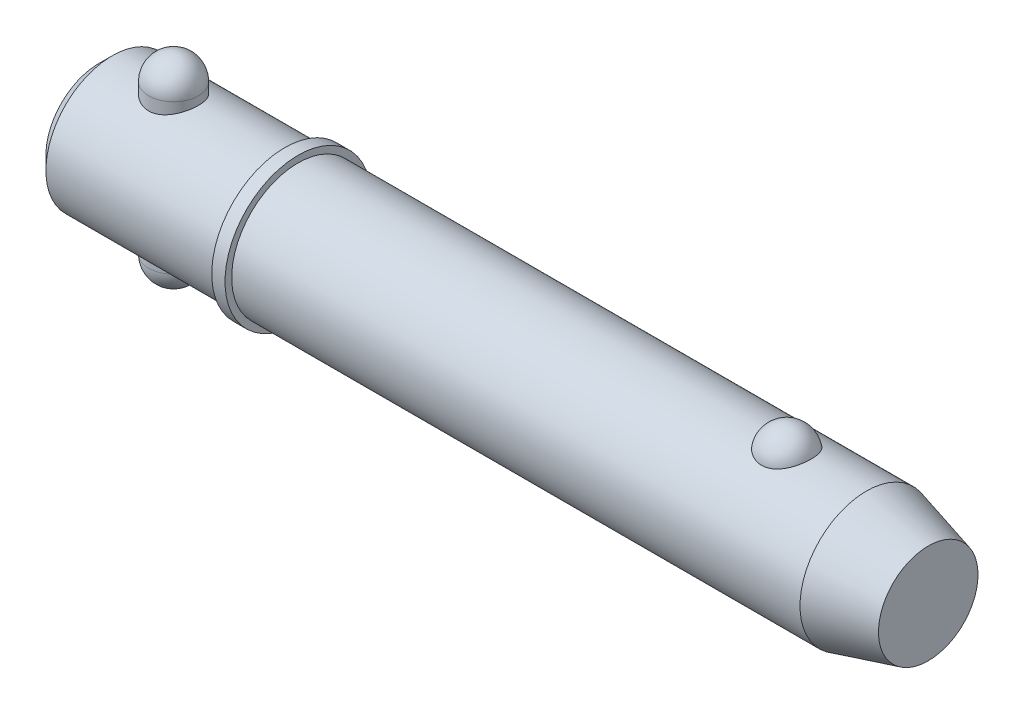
ISO-10303-21;
HEADER;
FILE_DESCRIPTION(('STEP AP214'),'2;1');
FILE_NAME('part.step','',(''),(''),'','','');
FILE_SCHEMA(('AUTOMOTIVE_DESIGN { 1 0 10303 214 1 1 1 1 }'));
ENDSEC;
DATA;
#1=APPLICATION_CONTEXT('core data for automotive mechanical design processes');
#2=APPLICATION_PROTOCOL_DEFINITION('international standard','automotive_design',2000,#1);
#3=PRODUCT_CONTEXT('',#1,'mechanical');
#4=PRODUCT('Part','Part','',(#3));
#5=PRODUCT_RELATED_PRODUCT_CATEGORY('part','',(#4));
#6=PRODUCT_DEFINITION_FORMATION('','',#4);
#7=PRODUCT_DEFINITION_CONTEXT('part definition',#1,'design');
#8=PRODUCT_DEFINITION('design','',#6,#7);
#9=PRODUCT_DEFINITION_SHAPE('','',#8);
#10=(LENGTH_UNIT() NAMED_UNIT(*) SI_UNIT(.MILLI.,.METRE.));
#11=(NAMED_UNIT(*) PLANE_ANGLE_UNIT() SI_UNIT($,.RADIAN.));
#12=(NAMED_UNIT(*) SI_UNIT($,.STERADIAN.) SOLID_ANGLE_UNIT());
#13=UNCERTAINTY_MEASURE_WITH_UNIT(LENGTH_MEASURE(1.E-05),#10,'distance_accuracy_value','');
#14=(GEOMETRIC_REPRESENTATION_CONTEXT(3) GLOBAL_UNCERTAINTY_ASSIGNED_CONTEXT((#13)) GLOBAL_UNIT_ASSIGNED_CONTEXT((#10,
#11,#12)) REPRESENTATION_CONTEXT('',''));
#15=CARTESIAN_POINT('',(0.,0.,0.));
#16=DIRECTION('',(0.,0.,1.));
#17=DIRECTION('',(1.,0.,0.));
#18=AXIS2_PLACEMENT_3D('',#15,#16,#17);
#19=CARTESIAN_POINT('',(14.28,19.05,0.));
#20=DIRECTION('',(0.,-1.,0.));
#21=DIRECTION('',(0.,0.,-1.));
#22=AXIS2_PLACEMENT_3D('',#19,#20,#21);
#23=CYLINDRICAL_SURFACE('',#22,4.76);
#24=CARTESIAN_POINT('',(14.28,-14.29,0.));
#25=DIRECTION('',(0.,-1.,0.));
#26=DIRECTION('',(0.,0.,-1.));
#27=AXIS2_PLACEMENT_3D('',#24,#25,#26);
#28=CIRCLE('',#27,4.76);
#29=CARTESIAN_POINT('',(14.28,-14.29,-4.76));
#30=VERTEX_POINT('',#29);
#31=EDGE_CURVE('P0_E10',#30,#30,#28,.F.);
#32=CARTESIAN_POINT('',(14.28,14.29,0.));
#33=DIRECTION('',(0.,-1.,0.));
#34=DIRECTION('',(0.,0.,-1.));
#35=AXIS2_PLACEMENT_3D('',#32,#33,#34);
#36=CIRCLE('',#35,4.76);
#37=CARTESIAN_POINT('',(14.28,14.29,-4.76));
#38=VERTEX_POINT('',#37);
#39=EDGE_CURVE('P0_E21',#38,#38,#36,.T.);
#40=CARTESIAN_POINT('',(14.28,-14.29,-4.76));
#41=CARTESIAN_POINT('',(14.28,-13.9922916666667,-4.76));
#42=CARTESIAN_POINT('',(14.28,-13.6945833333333,-4.76));
#43=CARTESIAN_POINT('',(14.28,-13.0991666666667,-4.76));
#44=CARTESIAN_POINT('',(14.28,-12.8014583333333,-4.76));
#45=CARTESIAN_POINT('',(14.28,-12.2060416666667,-4.76));
#46=CARTESIAN_POINT('',(14.28,-11.9083333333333,-4.76));
#47=CARTESIAN_POINT('',(14.28,-11.3129166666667,-4.76));
#48=CARTESIAN_POINT('',(14.28,-11.0152083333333,-4.76));
#49=CARTESIAN_POINT('',(14.28,-10.4197916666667,-4.76));
#50=CARTESIAN_POINT('',(14.28,-10.1220833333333,-4.76));
#51=CARTESIAN_POINT('',(14.28,-9.52666666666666,-4.76));
#52=CARTESIAN_POINT('',(14.28,-9.22895833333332,-4.76));
#53=CARTESIAN_POINT('',(14.28,-8.63354166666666,-4.76));
#54=CARTESIAN_POINT('',(14.28,-8.33583333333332,-4.76));
#55=CARTESIAN_POINT('',(14.28,-7.74041666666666,-4.76));
#56=CARTESIAN_POINT('',(14.28,-7.44270833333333,-4.76));
#57=CARTESIAN_POINT('',(14.28,-6.84729166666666,-4.76));
#58=CARTESIAN_POINT('',(14.28,-6.54958333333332,-4.76));
#59=CARTESIAN_POINT('',(14.28,-5.95416666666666,-4.76));
#60=CARTESIAN_POINT('',(14.28,-5.65645833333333,-4.76));
#61=CARTESIAN_POINT('',(14.28,-5.06104166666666,-4.76));
#62=CARTESIAN_POINT('',(14.28,-4.76333333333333,-4.76));
#63=CARTESIAN_POINT('',(14.28,-4.16791666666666,-4.76));
#64=CARTESIAN_POINT('',(14.28,-3.87020833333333,-4.76));
#65=CARTESIAN_POINT('',(14.28,-3.27479166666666,-4.76));
#66=CARTESIAN_POINT('',(14.28,-2.97708333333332,-4.76));
#67=CARTESIAN_POINT('',(14.28,-2.38166666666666,-4.76));
#68=CARTESIAN_POINT('',(14.28,-2.08395833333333,-4.76));
#69=CARTESIAN_POINT('',(14.28,-1.48854166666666,-4.76));
#70=CARTESIAN_POINT('',(14.28,-1.19083333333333,-4.76));
#71=CARTESIAN_POINT('',(14.28,-0.595416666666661,-4.76));
#72=CARTESIAN_POINT('',(14.28,-0.297708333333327,-4.76));
#73=CARTESIAN_POINT('',(14.28,0.297708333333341,-4.76));
#74=CARTESIAN_POINT('',(14.28,0.595416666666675,-4.76));
#75=CARTESIAN_POINT('',(14.28,1.19083333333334,-4.76));
#76=CARTESIAN_POINT('',(14.28,1.48854166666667,-4.76));
#77=CARTESIAN_POINT('',(14.28,2.08395833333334,-4.76));
#78=CARTESIAN_POINT('',(14.28,2.38166666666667,-4.76));
#79=CARTESIAN_POINT('',(14.28,2.97708333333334,-4.76));
#80=CARTESIAN_POINT('',(14.28,3.27479166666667,-4.76));
#81=CARTESIAN_POINT('',(14.28,3.87020833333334,-4.76));
#82=CARTESIAN_POINT('',(14.28,4.16791666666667,-4.76));
#83=CARTESIAN_POINT('',(14.28,4.76333333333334,-4.76));
#84=CARTESIAN_POINT('',(14.28,5.06104166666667,-4.76));
#85=CARTESIAN_POINT('',(14.28,5.65645833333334,-4.76));
#86=CARTESIAN_POINT('',(14.28,5.95416666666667,-4.76));
#87=CARTESIAN_POINT('',(14.28,6.54958333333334,-4.76));
#88=CARTESIAN_POINT('',(14.28,6.84729166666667,-4.76));
#89=CARTESIAN_POINT('',(14.28,7.44270833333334,-4.76));
#90=CARTESIAN_POINT('',(14.28,7.74041666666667,-4.76));
#91=CARTESIAN_POINT('',(14.28,8.33583333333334,-4.76));
#92=CARTESIAN_POINT('',(14.28,8.63354166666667,-4.76));
#93=CARTESIAN_POINT('',(14.28,9.22895833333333,-4.76));
#94=CARTESIAN_POINT('',(14.28,9.52666666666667,-4.76));
#95=CARTESIAN_POINT('',(14.28,10.1220833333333,-4.76));
#96=CARTESIAN_POINT('',(14.28,10.4197916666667,-4.76));
#97=CARTESIAN_POINT('',(14.28,11.0152083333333,-4.76));
#98=CARTESIAN_POINT('',(14.28,11.3129166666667,-4.76));
#99=CARTESIAN_POINT('',(14.28,11.9083333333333,-4.76));
#100=CARTESIAN_POINT('',(14.28,12.2060416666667,-4.76));
#101=CARTESIAN_POINT('',(14.28,12.8014583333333,-4.76));
#102=CARTESIAN_POINT('',(14.28,13.0991666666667,-4.76));
#103=CARTESIAN_POINT('',(14.28,13.6945833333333,-4.76));
#104=CARTESIAN_POINT('',(14.28,13.9922916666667,-4.76));
#105=CARTESIAN_POINT('',(14.28,14.29,-4.76));
#106=B_SPLINE_CURVE_WITH_KNOTS('',3,(#40,#41,#42,#43,#44,#45,#46,#47,#48,#49,#50,#51,#52,#53,
#54,#55,#56,#57,#58,#59,#60,#61,#62,#63,#64,#65,#66,#67,#68,#69,#70,#71,#72,#73,#74,#75,#76,#77,
#78,#79,#80,#81,#82,#83,#84,#85,#86,#87,#88,#89,#90,#91,#92,#93,#94,#95,#96,#97,#98,#99,#100,
#101,#102,#103,#104,#105),.UNSPECIFIED.,.F.,.F.,(4,2,2,2,2,2,2,2,2,2,2,2,2,2,2,2,2,2,2,2,2,2,2,
2,2,2,2,2,2,2,2,2,4),(0.,0.893125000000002,1.78625,2.67937499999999,3.5725,4.465625,5.35875,
6.25187499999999,7.145,8.038125,8.93125,9.82437499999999,10.7175,11.610625,12.50375,13.396875,
14.29,15.183125,16.07625,16.969375,17.8625,18.755625,19.64875,20.541875,21.435,22.328125,
23.22125,24.114375,25.0075,25.900625,26.79375,27.686875,28.58),.UNSPECIFIED.);
#107=EDGE_CURVE('P0_BSEAM14',#30,#38,#106,.T.);
#108=ORIENTED_EDGE('',*,*,#31,.T.);
#109=ORIENTED_EDGE('',*,*,#39,.T.);
#110=ORIENTED_EDGE('',*,*,#107,.T.);
#111=ORIENTED_EDGE('',*,*,#107,.F.);
#112=EDGE_LOOP('',(#108,#110,#109,#111));
#113=FACE_BOUND('',#112,.T.);
#114=ADVANCED_FACE('P0_F14',(#113),#23,.T.);
#115=CARTESIAN_POINT('',(14.28,-14.29,0.));
#116=DIRECTION('',(0.,0.,1.));
#117=DIRECTION('',(1.,0.,0.));
#118=AXIS2_PLACEMENT_3D('',#115,#116,#117);
#119=SPHERICAL_SURFACE('',#118,4.76);
#120=CARTESIAN_POINT('',(14.28,-14.29,0.));
#121=DIRECTION('',(0.,-1.,0.));
#122=DIRECTION('',(0.,0.,-1.));
#123=AXIS2_PLACEMENT_3D('',#120,#121,#122);
#124=SPHERICAL_SURFACE('',#123,4.76);
#125=ORIENTED_EDGE('',*,*,#31,.F.);
#126=EDGE_LOOP('',(#125));
#127=FACE_BOUND('',#126,.T.);
#128=ADVANCED_FACE('P0_F29',(#127),#124,.T.);
#129=CARTESIAN_POINT('',(14.28,14.29,0.));
#130=DIRECTION('',(0.,0.,1.));
#131=DIRECTION('',(1.,0.,0.));
#132=AXIS2_PLACEMENT_3D('',#129,#130,#131);
#133=SPHERICAL_SURFACE('',#132,4.76);
#134=CARTESIAN_POINT('',(14.28,14.29,0.));
#135=DIRECTION('',(0.,-1.,0.));
#136=DIRECTION('',(0.,0.,-1.));
#137=AXIS2_PLACEMENT_3D('',#134,#135,#136);
#138=SPHERICAL_SURFACE('',#137,4.76);
#139=ORIENTED_EDGE('',*,*,#39,.F.);
#140=EDGE_LOOP('',(#139));
#141=FACE_BOUND('',#140,.T.);
#142=ADVANCED_FACE('P0_F16',(#141),#138,.T.);
#143=CLOSED_SHELL('',(#114,#128,#142));
#144=MANIFOLD_SOLID_BREP('P0_B1',#143);
#145=CARTESIAN_POINT('',(0.,0.,0.));
#146=DIRECTION('',(1.,0.,0.));
#147=DIRECTION('',(0.,0.,-1.));
#148=AXIS2_PLACEMENT_3D('',#145,#146,#147);
#149=CYLINDRICAL_SURFACE('',#148,12.7);
#150=CARTESIAN_POINT('',(146.900738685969,0.,0.));
#151=DIRECTION('',(1.,0.,0.));
#152=DIRECTION('',(0.,0.,-1.));
#153=AXIS2_PLACEMENT_3D('',#150,#151,#152);
#154=CIRCLE('',#153,12.7);
#155=CARTESIAN_POINT('',(146.900738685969,0.,-12.7));
#156=VERTEX_POINT('',#155);
#157=EDGE_CURVE('P1_E81',#156,#156,#154,.T.);
#158=ORIENTED_EDGE('',*,*,#157,.F.);
#159=EDGE_LOOP('',(#158));
#160=FACE_BOUND('',#159,.T.);
#161=CARTESIAN_POINT('',(38.1,0.,0.));
#162=DIRECTION('',(1.,0.,0.));
#163=DIRECTION('',(0.,0.,-1.));
#164=AXIS2_PLACEMENT_3D('',#161,#162,#163);
#165=CIRCLE('',#164,12.7);
#166=CARTESIAN_POINT('',(38.1,0.,-12.7));
#167=VERTEX_POINT('',#166);
#168=EDGE_CURVE('P1_E85',#167,#167,#165,.T.);
#169=ORIENTED_EDGE('',*,*,#168,.T.);
#170=EDGE_LOOP('',(#169));
#171=FACE_BOUND('',#170,.T.);
#172=CARTESIAN_POINT('',(131.660042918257,11.7500437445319,4.81938502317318));
#173=CARTESIAN_POINT('',(131.535088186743,11.7500430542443,4.81938571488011));
#174=CARTESIAN_POINT('',(131.410144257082,11.7520975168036,4.81438658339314));
#175=CARTESIAN_POINT('',(131.161142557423,11.760253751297,4.79442904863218));
#176=CARTESIAN_POINT('',(131.037085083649,11.7663568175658,4.77946746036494));
#177=CARTESIAN_POINT('',(130.790901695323,11.7824262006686,4.7397141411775));
#178=CARTESIAN_POINT('',(130.668774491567,11.7923898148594,4.71492928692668));
#179=CARTESIAN_POINT('',(130.427187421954,11.8158938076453,4.65571340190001));
#180=CARTESIAN_POINT('',(130.30772859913,11.8294355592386,4.6212786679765));
#181=CARTESIAN_POINT('',(130.072557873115,11.8596812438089,4.54309502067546));
#182=CARTESIAN_POINT('',(129.956839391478,11.8763792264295,4.49936361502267));
#183=CARTESIAN_POINT('',(129.729653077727,11.9124878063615,4.40287235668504));
#184=CARTESIAN_POINT('',(129.618186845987,11.9318994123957,4.35010914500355));
#185=CARTESIAN_POINT('',(129.291278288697,11.9934256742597,4.17881316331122));
#186=CARTESIAN_POINT('',(129.083127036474,12.038858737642,4.04720756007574));
#187=CARTESIAN_POINT('',(128.685850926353,12.1352173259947,3.748564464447));
#188=CARTESIAN_POINT('',(128.497443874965,12.1862630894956,3.58061821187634));
#189=CARTESIAN_POINT('',(128.150521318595,12.2875163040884,3.21600758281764));
#190=CARTESIAN_POINT('',(127.992011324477,12.3377235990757,3.0193379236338));
#191=CARTESIAN_POINT('',(127.70168878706,12.4344923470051,2.592916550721));
#192=CARTESIAN_POINT('',(127.571376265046,12.4807925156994,2.36208286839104));
#193=CARTESIAN_POINT('',(127.349407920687,12.5623454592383,1.88070399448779));
#194=CARTESIAN_POINT('',(127.257755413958,12.5975972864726,1.63015711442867));
#195=CARTESIAN_POINT('',(127.114046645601,12.6538414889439,1.1129886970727));
#196=CARTESIAN_POINT('',(127.062499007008,12.6746503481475,0.846205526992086));
#197=CARTESIAN_POINT('',(127.001977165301,12.699153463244,0.307085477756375));
#198=CARTESIAN_POINT('',(126.993001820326,12.7028481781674,0.034748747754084));
#199=CARTESIAN_POINT('',(127.017731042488,12.6927785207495,-0.506073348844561));
#200=CARTESIAN_POINT('',(127.051189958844,12.6791146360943,-0.774571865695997));
#201=CARTESIAN_POINT('',(127.159687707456,12.635882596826,-1.30170246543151));
#202=CARTESIAN_POINT('',(127.23472729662,12.606314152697,-1.56033436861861));
#203=CARTESIAN_POINT('',(127.42500006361,12.5342328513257,-2.0608389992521));
#204=CARTESIAN_POINT('',(127.540287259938,12.4917026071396,-2.30268867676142));
#205=CARTESIAN_POINT('',(127.808704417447,12.3981123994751,-2.76259600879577));
#206=CARTESIAN_POINT('',(127.961837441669,12.3470517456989,-2.98065173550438));
#207=CARTESIAN_POINT('',(128.303507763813,12.2416045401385,-3.38786328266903));
#208=CARTESIAN_POINT('',(128.492201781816,12.1872040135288,-3.57688418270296));
#209=CARTESIAN_POINT('',(128.900239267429,12.0814086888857,-3.91941073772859));
#210=CARTESIAN_POINT('',(129.119580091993,12.0300136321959,-4.07291945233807));
#211=CARTESIAN_POINT('',(129.578375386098,11.9373542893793,-4.33691289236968));
#212=CARTESIAN_POINT('',(129.817304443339,11.8958982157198,-4.44824125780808));
#213=CARTESIAN_POINT('',(130.31243761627,11.8268116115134,-4.62881985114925));
#214=CARTESIAN_POINT('',(130.568635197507,11.7991758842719,-4.69808589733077));
#215=CARTESIAN_POINT('',(131.077164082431,11.7622209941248,-4.78983181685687));
#216=CARTESIAN_POINT('',(131.329041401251,11.7520502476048,-4.81449025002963));
#217=CARTESIAN_POINT('',(131.833573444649,11.7485796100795,-4.82295735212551));
#218=CARTESIAN_POINT('',(132.086228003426,11.7552763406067,-4.80677420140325));
#219=CARTESIAN_POINT('',(132.576834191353,11.7842584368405,-4.73525430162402));
#220=CARTESIAN_POINT('',(132.814998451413,11.8060486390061,-4.68116061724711));
#221=CARTESIAN_POINT('',(133.278489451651,11.8622750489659,-4.53678133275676));
#222=CARTESIAN_POINT('',(133.503815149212,11.8967122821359,-4.44649279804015));
#223=CARTESIAN_POINT('',(133.940801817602,11.9754603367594,-4.2298761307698));
#224=CARTESIAN_POINT('',(134.152057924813,12.0199699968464,-4.10280539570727));
#225=CARTESIAN_POINT('',(134.550601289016,12.1138028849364,-3.81685409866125));
#226=CARTESIAN_POINT('',(134.737883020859,12.163127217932,-3.65796622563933));
#227=CARTESIAN_POINT('',(135.093350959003,12.2642343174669,-3.30364864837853));
#228=CARTESIAN_POINT('',(135.260111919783,12.3160165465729,-3.10678783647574));
#229=CARTESIAN_POINT('',(135.559579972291,12.4142566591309,-2.68748409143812));
#230=CARTESIAN_POINT('',(135.692280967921,12.4607135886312,-2.4650365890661));
#231=CARTESIAN_POINT('',(135.924691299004,12.5450236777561,-1.9928951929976));
#232=CARTESIAN_POINT('',(136.023215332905,12.5825557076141,-1.74255918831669));
#233=CARTESIAN_POINT('',(136.179227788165,12.6431720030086,-1.22773734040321));
#234=CARTESIAN_POINT('',(136.236715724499,12.6662560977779,-0.963251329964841));
#235=CARTESIAN_POINT('',(136.309544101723,12.6956486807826,-0.4273550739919));
#236=CARTESIAN_POINT('',(136.324837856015,12.7019385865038,-0.155937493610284));
#237=CARTESIAN_POINT('',(136.312779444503,12.6970201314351,0.38592890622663));
#238=CARTESIAN_POINT('',(136.28542805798,12.6858120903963,0.656377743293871));
#239=CARTESIAN_POINT('',(136.213060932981,12.6568455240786,1.05454017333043));
#240=CARTESIAN_POINT('',(136.183796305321,12.6451962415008,1.185778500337));
#241=CARTESIAN_POINT('',(136.115022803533,12.6181819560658,1.44513808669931));
#242=CARTESIAN_POINT('',(136.075517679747,12.6028183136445,1.57326046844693));
#243=CARTESIAN_POINT('',(135.986439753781,12.5687547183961,1.82554978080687));
#244=CARTESIAN_POINT('',(135.936862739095,12.5500533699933,1.94971503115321));
#245=CARTESIAN_POINT('',(135.82792115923,12.5098093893,2.19314370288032));
#246=CARTESIAN_POINT('',(135.768560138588,12.4882677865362,2.31240887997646));
#247=CARTESIAN_POINT('',(135.63997128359,12.4427679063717,2.5459303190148));
#248=CARTESIAN_POINT('',(135.570688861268,12.4187964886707,2.66015396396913));
#249=CARTESIAN_POINT('',(135.422903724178,12.3691892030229,2.88202659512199));
#250=CARTESIAN_POINT('',(135.344404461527,12.3435539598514,2.98967802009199));
#251=CARTESIAN_POINT('',(135.178550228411,12.2912955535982,3.1977438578));
#252=CARTESIAN_POINT('',(135.091191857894,12.2646720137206,3.29815546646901));
#253=CARTESIAN_POINT('',(134.908161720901,12.2111945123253,3.49095035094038));
#254=CARTESIAN_POINT('',(134.812493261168,12.1843406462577,3.58333679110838));
#255=CARTESIAN_POINT('',(134.613627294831,12.1312249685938,3.75922876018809));
#256=CARTESIAN_POINT('',(134.510450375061,12.104961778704,3.84275713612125));
#257=CARTESIAN_POINT('',(134.29701336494,12.0537284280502,4.00056406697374));
#258=CARTESIAN_POINT('',(134.186756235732,12.028757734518,4.07484645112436));
#259=CARTESIAN_POINT('',(133.959755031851,11.9808306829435,4.21367959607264));
#260=CARTESIAN_POINT('',(133.843006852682,11.9578756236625,4.27822410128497));
#261=CARTESIAN_POINT('',(133.60394258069,11.9147184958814,4.39698483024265));
#262=CARTESIAN_POINT('',(133.481628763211,11.894515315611,4.45120522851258));
#263=CARTESIAN_POINT('',(133.222952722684,11.8561129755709,4.55255353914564));
#264=CARTESIAN_POINT('',(133.086223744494,11.8381764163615,4.59884858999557));
#265=CARTESIAN_POINT('',(132.808608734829,11.8069093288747,4.67853897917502));
#266=CARTESIAN_POINT('',(132.667724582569,11.7935767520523,4.71194005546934));
#267=CARTESIAN_POINT('',(132.38309446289,11.7720277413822,4.76552188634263));
#268=CARTESIAN_POINT('',(132.239348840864,11.7638106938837,4.78570422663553));
#269=CARTESIAN_POINT('',(131.950411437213,11.7528195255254,4.81263433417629));
#270=CARTESIAN_POINT('',(131.805219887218,11.7500445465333,4.81938421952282));
#271=CARTESIAN_POINT('',(131.660042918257,11.7500437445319,4.81938502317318));
#272=B_SPLINE_CURVE_WITH_KNOTS('',3,(#172,#173,#174,#175,#176,#177,#178,#179,#180,#181,#182,
#183,#184,#185,#186,#187,#188,#189,#190,#191,#192,#193,#194,#195,#196,#197,#198,#199,#200,#201,
#202,#203,#204,#205,#206,#207,#208,#209,#210,#211,#212,#213,#214,#215,#216,#217,#218,#219,#220,
#221,#222,#223,#224,#225,#226,#227,#228,#229,#230,#231,#232,#233,#234,#235,#236,#237,#238,#239,
#240,#241,#242,#243,#244,#245,#246,#247,#248,#249,#250,#251,#252,#253,#254,#255,#256,#257,#258,
#259,#260,#261,#262,#263,#264,#265,#266,#267,#268,#269,#270,#271),.UNSPECIFIED.,.T.,.F.,(4,2,2,
2,2,2,2,2,2,2,2,2,2,2,2,2,2,2,2,2,2,2,2,2,2,2,2,2,2,2,2,2,2,2,2,2,2,2,2,2,2,2,2,2,2,2,2,2,2,4),
(0.,0.374729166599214,0.749578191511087,1.12416526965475,1.49889629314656,1.87292776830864,
2.24709865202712,2.99481328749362,3.76399449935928,4.53331735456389,5.3368391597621,
6.14042986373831,6.95405296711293,7.76765424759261,8.57656703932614,9.38549455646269,
10.1955119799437,11.0055949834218,11.8193353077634,12.6330054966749,13.4294141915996,
14.2255231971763,14.9815786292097,15.7374826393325,16.4696948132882,17.2019663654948,
17.9501979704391,18.6986017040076,19.4844704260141,20.2704797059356,21.0815215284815,
21.8925729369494,22.7045213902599,23.5164550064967,23.9209608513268,24.3253187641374,
24.7298461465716,25.1342272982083,25.54092555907,25.9474719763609,26.3541750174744,
26.7607169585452,27.1661834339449,27.5714814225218,27.9770386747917,28.3824315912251,
28.818120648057,29.2536155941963,29.6890582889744,30.1244323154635),.UNSPECIFIED.);
#273=CARTESIAN_POINT('',(131.660042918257,11.7500437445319,4.81938502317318));
#274=VERTEX_POINT('',#273);
#275=EDGE_CURVE('P1_E35',#274,#274,#272,.T.);
#276=ORIENTED_EDGE('',*,*,#275,.T.);
#277=EDGE_LOOP('',(#276));
#278=FACE_BOUND('',#277,.T.);
#279=ADVANCED_FACE('P1_F13',(#160,#171,#278),#149,.T.);
#280=CARTESIAN_POINT('',(0.,0.,0.));
#281=DIRECTION('',(-1.,0.,0.));
#282=DIRECTION('',(0.,0.,1.));
#283=AXIS2_PLACEMENT_3D('',#280,#281,#282);
#284=PLANE('',#283);
#285=CARTESIAN_POINT('',(0.,0.,0.));
#286=DIRECTION('',(1.,0.,0.));
#287=DIRECTION('',(0.,0.,-1.));
#288=AXIS2_PLACEMENT_3D('',#285,#286,#287);
#289=CIRCLE('',#288,10.16);
#290=CARTESIAN_POINT('',(0.,0.,-10.16));
#291=VERTEX_POINT('',#290);
#292=EDGE_CURVE('P1_E9',#291,#291,#289,.T.);
#293=ORIENTED_EDGE('',*,*,#292,.F.);
#294=EDGE_LOOP('',(#293));
#295=FACE_BOUND('',#294,.T.);
#296=ADVANCED_FACE('P1_F15',(#295),#284,.T.);
#297=CARTESIAN_POINT('',(2.53999999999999,0.,0.));
#298=DIRECTION('',(1.,0.,0.));
#299=DIRECTION('',(0.,0.,-1.));
#300=AXIS2_PLACEMENT_3D('',#297,#298,#299);
#301=CONICAL_SURFACE('',#300,12.7,0.78539816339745);
#302=ORIENTED_EDGE('',*,*,#292,.T.);
#303=EDGE_LOOP('',(#302));
#304=FACE_BOUND('',#303,.T.);
#305=CARTESIAN_POINT('',(2.53999999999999,0.,0.));
#306=DIRECTION('',(1.,0.,0.));
#307=DIRECTION('',(0.,0.,-1.));
#308=AXIS2_PLACEMENT_3D('',#305,#306,#307);
#309=CIRCLE('',#308,12.7);
#310=CARTESIAN_POINT('',(2.53999999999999,0.,-12.7));
#311=VERTEX_POINT('',#310);
#312=EDGE_CURVE('P1_E26',#311,#311,#309,.T.);
#313=ORIENTED_EDGE('',*,*,#312,.F.);
#314=EDGE_LOOP('',(#313));
#315=FACE_BOUND('',#314,.T.);
#316=ADVANCED_FACE('P1_F77',(#304,#315),#301,.T.);
#317=CARTESIAN_POINT('',(0.,0.,0.));
#318=DIRECTION('',(1.,0.,0.));
#319=DIRECTION('',(0.,0.,-1.));
#320=AXIS2_PLACEMENT_3D('',#317,#318,#319);
#321=CYLINDRICAL_SURFACE('',#320,12.7);
#322=CARTESIAN_POINT('',(14.28,-11.7742260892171,4.76));
#323=CARTESIAN_POINT('',(14.1514948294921,-11.7742255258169,4.76000061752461));
#324=CARTESIAN_POINT('',(14.0229980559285,-11.7763355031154,4.75479194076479));
#325=CARTESIAN_POINT('',(13.7669369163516,-11.7847043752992,4.73401198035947));
#326=CARTESIAN_POINT('',(13.6393728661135,-11.7909646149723,4.71843733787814));
#327=CARTESIAN_POINT('',(13.386226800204,-11.8074248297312,4.67709434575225));
#328=CARTESIAN_POINT('',(13.2606439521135,-11.8176231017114,4.65133040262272));
#329=CARTESIAN_POINT('',(13.0122434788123,-11.8416347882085,4.58985545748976));
#330=CARTESIAN_POINT('',(12.8894269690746,-11.8554496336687,4.55414051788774));
#331=CARTESIAN_POINT('',(12.6477622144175,-11.8862222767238,4.47320764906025));
#332=CARTESIAN_POINT('',(12.5289037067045,-11.9031710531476,4.4280169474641));
#333=CARTESIAN_POINT('',(12.2955059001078,-11.939736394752,4.32845291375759));
#334=CARTESIAN_POINT('',(12.1809682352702,-11.9593539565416,4.2740761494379));
#335=CARTESIAN_POINT('',(11.8448901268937,-12.0213893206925,4.09777237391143));
#336=CARTESIAN_POINT('',(11.6307077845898,-12.0670135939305,3.9626122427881));
#337=CARTESIAN_POINT('',(11.2179129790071,-12.1641514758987,3.65386230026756));
#338=CARTESIAN_POINT('',(11.0204399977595,-12.2158379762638,3.47881300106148));
#339=CARTESIAN_POINT('',(10.6568212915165,-12.3178468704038,3.09829182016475));
#340=CARTESIAN_POINT('',(10.4906822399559,-12.3681689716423,2.89281347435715));
#341=CARTESIAN_POINT('',(10.1890299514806,-12.4638367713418,2.44867909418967));
#342=CARTESIAN_POINT('',(10.054749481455,-12.5089552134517,2.20913281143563));
#343=CARTESIAN_POINT('',(9.82886079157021,-12.5870472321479,1.70885919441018));
#344=CARTESIAN_POINT('',(9.73723778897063,-12.620025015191,1.44813923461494));
#345=CARTESIAN_POINT('',(9.60324488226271,-12.6688874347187,0.9248423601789));
#346=CARTESIAN_POINT('',(9.55892269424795,-12.6854474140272,0.662829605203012));
#347=CARTESIAN_POINT('',(9.5145335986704,-12.7020320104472,0.134596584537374));
#348=CARTESIAN_POINT('',(9.5144523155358,-12.7020619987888,-0.131622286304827));
#349=CARTESIAN_POINT('',(9.55741019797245,-12.6860129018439,-0.646717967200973));
#350=CARTESIAN_POINT('',(9.59831845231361,-12.6707298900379,-0.895801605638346));
#351=CARTESIAN_POINT('',(9.71850987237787,-12.6268158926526,-1.38327219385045));
#352=CARTESIAN_POINT('',(9.79779575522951,-12.5981839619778,-1.62165838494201));
#353=CARTESIAN_POINT('',(9.99348296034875,-12.5298894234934,-2.08508424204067));
#354=CARTESIAN_POINT('',(10.110407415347,-12.4900724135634,-2.30987931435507));
#355=CARTESIAN_POINT('',(10.3775896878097,-12.4034373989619,-2.7372158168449));
#356=CARTESIAN_POINT('',(10.5278582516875,-12.3566171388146,-2.93975004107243));
#357=CARTESIAN_POINT('',(10.8677318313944,-12.257571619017,-3.32936830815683));
#358=CARTESIAN_POINT('',(11.0591227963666,-12.2051903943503,-3.51485714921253));
#359=CARTESIAN_POINT('',(11.4706087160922,-12.1031155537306,-3.85170663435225));
#360=CARTESIAN_POINT('',(11.6907108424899,-12.0534226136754,-4.00305872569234));
#361=CARTESIAN_POINT('',(12.1596597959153,-11.9613684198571,-4.27038218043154));
#362=CARTESIAN_POINT('',(12.4090353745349,-11.9191939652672,-4.38549550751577));
#363=CARTESIAN_POINT('',(12.9256290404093,-11.8491124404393,-4.57149117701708));
#364=CARTESIAN_POINT('',(13.1928371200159,-11.8211974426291,-4.64239810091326));
#365=CARTESIAN_POINT('',(13.7217488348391,-11.7846654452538,-4.73434137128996));
#366=CARTESIAN_POINT('',(13.9829438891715,-11.7750694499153,-4.75791141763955));
#367=CARTESIAN_POINT('',(14.5056760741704,-11.7734909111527,-4.76182097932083));
#368=CARTESIAN_POINT('',(14.7672131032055,-11.7815039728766,-4.74217128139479));
#369=CARTESIAN_POINT('',(15.2702140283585,-11.8132466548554,-4.66249544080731));
#370=CARTESIAN_POINT('',(15.5120417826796,-11.8362133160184,-4.60442726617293));
#371=CARTESIAN_POINT('',(15.9824097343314,-11.8943704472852,-4.45202868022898));
#372=CARTESIAN_POINT('',(16.2109472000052,-11.9295634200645,-4.35769084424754));
#373=CARTESIAN_POINT('',(16.6577741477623,-12.0098310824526,-4.13144368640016));
#374=CARTESIAN_POINT('',(16.8753590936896,-12.055226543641,-3.99825937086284));
#375=CARTESIAN_POINT('',(17.2859732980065,-12.150238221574,-3.69949845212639));
#376=CARTESIAN_POINT('',(17.4789935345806,-12.19985597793,-3.5339100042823));
#377=CARTESIAN_POINT('',(17.8477707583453,-12.3015434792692,-3.1624728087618));
#378=CARTESIAN_POINT('',(18.0216609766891,-12.3535695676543,-2.95473880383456));
#379=CARTESIAN_POINT('',(18.254545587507,-12.426745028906,-2.62277433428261));
#380=CARTESIAN_POINT('',(18.3275489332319,-12.4503382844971,-2.50865480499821));
#381=CARTESIAN_POINT('',(18.463723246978,-12.4952713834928,-2.27428971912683));
#382=CARTESIAN_POINT('',(18.5268984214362,-12.5166121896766,-2.15404681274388));
#383=CARTESIAN_POINT('',(18.6427140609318,-12.5563817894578,-1.90858448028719));
#384=CARTESIAN_POINT('',(18.6953855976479,-12.5748191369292,-1.78338108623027));
#385=CARTESIAN_POINT('',(18.7899337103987,-12.6083284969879,-1.52857834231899));
#386=CARTESIAN_POINT('',(18.8318147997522,-12.6234019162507,-1.39898085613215));
#387=CARTESIAN_POINT('',(18.9043819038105,-12.6497495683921,-1.13633254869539));
#388=CARTESIAN_POINT('',(18.9350698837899,-12.6610244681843,-1.00328233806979));
#389=CARTESIAN_POINT('',(18.9849303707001,-12.6794412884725,-0.734761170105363));
#390=CARTESIAN_POINT('',(19.0041035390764,-12.6865834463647,-0.59929035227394));
#391=CARTESIAN_POINT('',(19.0299427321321,-12.6962286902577,-0.335006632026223));
#392=CARTESIAN_POINT('',(19.0372742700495,-12.698978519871,-0.206267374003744));
#393=CARTESIAN_POINT('',(19.0414668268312,-12.7005496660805,0.0514515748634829));
#394=CARTESIAN_POINT('',(19.038324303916,-12.69936965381,0.180431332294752));
#395=CARTESIAN_POINT('',(19.0215965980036,-12.6931114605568,0.437551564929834));
#396=CARTESIAN_POINT('',(19.0080165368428,-12.6880351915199,0.565692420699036));
#397=CARTESIAN_POINT('',(18.9705519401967,-12.6741222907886,0.820297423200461));
#398=CARTESIAN_POINT('',(18.9466635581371,-12.665284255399,0.946760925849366));
#399=CARTESIAN_POINT('',(18.8895279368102,-12.6443449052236,1.19395899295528));
#400=CARTESIAN_POINT('',(18.8565273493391,-12.6323299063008,1.3147578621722));
#401=CARTESIAN_POINT('',(18.781239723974,-12.6052503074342,1.55308888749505));
#402=CARTESIAN_POINT('',(18.738949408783,-12.5901846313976,1.67061987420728));
#403=CARTESIAN_POINT('',(18.5986461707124,-12.5409473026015,2.01714406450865));
#404=CARTESIAN_POINT('',(18.4871532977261,-12.502717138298,2.24027279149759));
#405=CARTESIAN_POINT('',(18.2262440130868,-12.4173042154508,2.6742599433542));
#406=CARTESIAN_POINT('',(18.0754310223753,-12.3698127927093,2.88420891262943));
#407=CARTESIAN_POINT('',(17.7421836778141,-12.271667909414,3.27675114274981));
#408=CARTESIAN_POINT('',(17.5597380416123,-12.2210133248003,3.45933459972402));
#409=CARTESIAN_POINT('',(17.2605468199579,-12.1452079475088,3.7138066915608));
#410=CARTESIAN_POINT('',(17.1535518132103,-12.119328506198,3.79719993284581));
#411=CARTESIAN_POINT('',(16.9326449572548,-12.0688597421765,3.95467398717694));
#412=CARTESIAN_POINT('',(16.8187356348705,-12.0442699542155,4.02875817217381));
#413=CARTESIAN_POINT('',(16.5846234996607,-11.9971053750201,4.16711104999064));
#414=CARTESIAN_POINT('',(16.4644172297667,-11.9745317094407,4.23137427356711));
#415=CARTESIAN_POINT('',(16.2185866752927,-11.9321360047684,4.34949041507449));
#416=CARTESIAN_POINT('',(16.09296473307,-11.9123127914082,4.40334777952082));
#417=CARTESIAN_POINT('',(15.8314769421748,-11.875268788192,4.50232278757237));
#418=CARTESIAN_POINT('',(15.6954035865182,-11.8582009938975,4.54695127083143));
#419=CARTESIAN_POINT('',(15.4194002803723,-11.8284328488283,4.62383807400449));
#420=CARTESIAN_POINT('',(15.2794720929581,-11.815730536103,4.6561019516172));
#421=CARTESIAN_POINT('',(14.9969657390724,-11.7951940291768,4.70788444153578));
#422=CARTESIAN_POINT('',(14.8543884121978,-11.7873583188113,4.72740702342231));
#423=CARTESIAN_POINT('',(14.5678704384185,-11.7768749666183,4.75346370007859));
#424=CARTESIAN_POINT('',(14.4239299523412,-11.7742267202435,4.75999930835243));
#425=CARTESIAN_POINT('',(14.28,-11.7742260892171,4.76));
#426=B_SPLINE_CURVE_WITH_KNOTS('',3,(#322,#323,#324,#325,#326,#327,#328,#329,#330,#331,#332,
#333,#334,#335,#336,#337,#338,#339,#340,#341,#342,#343,#344,#345,#346,#347,#348,#349,#350,#351,
#352,#353,#354,#355,#356,#357,#358,#359,#360,#361,#362,#363,#364,#365,#366,#367,#368,#369,#370,
#371,#372,#373,#374,#375,#376,#377,#378,#379,#380,#381,#382,#383,#384,#385,#386,#387,#388,#389,
#390,#391,#392,#393,#394,#395,#396,#397,#398,#399,#400,#401,#402,#403,#404,#405,#406,#407,#408,
#409,#410,#411,#412,#413,#414,#415,#416,#417,#418,#419,#420,#421,#422,#423,#424,#425),
.UNSPECIFIED.,.T.,.F.,(4,2,2,2,2,2,2,2,2,2,2,2,2,2,2,2,2,2,2,2,2,2,2,2,2,2,2,2,2,2,2,2,2,2,2,2,
2,2,2,2,2,2,2,2,2,2,2,2,2,2,2,4),(0.,0.385378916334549,0.770882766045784,1.15622008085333,
1.54171009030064,1.92610725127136,2.31064835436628,3.07917291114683,3.88239385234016,
4.68578566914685,5.51648193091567,6.34689010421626,7.14151420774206,7.93588010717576,
8.69098665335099,9.44614666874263,10.2122918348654,10.9786842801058,11.789876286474,
12.6012713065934,13.4306405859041,14.2595482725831,15.0427613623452,15.8257790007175,
16.5716820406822,17.3177378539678,18.0917395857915,18.8660247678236,19.6893332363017,
20.1014571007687,20.5134040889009,20.9241137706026,21.3346513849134,21.7451168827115,
22.1555587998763,22.542011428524,22.928594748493,23.3149884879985,23.7015265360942,
24.0784835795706,24.4555738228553,25.2091300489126,25.994347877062,26.7798463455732,
27.1937428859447,27.6074890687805,28.0214648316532,28.4352633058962,28.8672794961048,
29.299101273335,29.7307884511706,30.1624253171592),.UNSPECIFIED.);
#427=CARTESIAN_POINT('',(14.28,-11.7742260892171,4.76));
#428=VERTEX_POINT('',#427);
#429=EDGE_CURVE('P1_E17',#428,#428,#426,.T.);
#430=ORIENTED_EDGE('',*,*,#429,.F.);
#431=EDGE_LOOP('',(#430));
#432=FACE_BOUND('',#431,.T.);
#433=CARTESIAN_POINT('',(14.28,11.7742260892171,4.76));
#434=CARTESIAN_POINT('',(14.4085051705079,11.7742255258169,4.76000061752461));
#435=CARTESIAN_POINT('',(14.5370019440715,11.7763355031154,4.75479194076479));
#436=CARTESIAN_POINT('',(14.7930630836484,11.7847043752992,4.73401198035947));
#437=CARTESIAN_POINT('',(14.9206271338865,11.7909646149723,4.71843733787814));
#438=CARTESIAN_POINT('',(15.173773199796,11.8074248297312,4.67709434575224));
#439=CARTESIAN_POINT('',(15.2993560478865,11.8176231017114,4.65133040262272));
#440=CARTESIAN_POINT('',(15.5477565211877,11.8416347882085,4.58985545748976));
#441=CARTESIAN_POINT('',(15.6705730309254,11.8554496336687,4.55414051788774));
#442=CARTESIAN_POINT('',(15.9122377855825,11.8862222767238,4.47320764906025));
#443=CARTESIAN_POINT('',(16.0310962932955,11.9031710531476,4.4280169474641));
#444=CARTESIAN_POINT('',(16.2644940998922,11.939736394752,4.32845291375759));
#445=CARTESIAN_POINT('',(16.3790317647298,11.9593539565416,4.2740761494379));
#446=CARTESIAN_POINT('',(16.7151098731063,12.0213893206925,4.09777237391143));
#447=CARTESIAN_POINT('',(16.9292922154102,12.0670135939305,3.96261224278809));
#448=CARTESIAN_POINT('',(17.3420870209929,12.1641514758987,3.65386230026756));
#449=CARTESIAN_POINT('',(17.5395600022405,12.2158379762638,3.47881300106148));
#450=CARTESIAN_POINT('',(17.9031787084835,12.3178468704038,3.09829182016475));
#451=CARTESIAN_POINT('',(18.0693177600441,12.3681689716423,2.89281347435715));
#452=CARTESIAN_POINT('',(18.3709700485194,12.4638367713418,2.44867909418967));
#453=CARTESIAN_POINT('',(18.505250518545,12.5089552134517,2.20913281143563));
#454=CARTESIAN_POINT('',(18.7311392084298,12.5870472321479,1.70885919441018));
#455=CARTESIAN_POINT('',(18.8227622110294,12.620025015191,1.44813923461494));
#456=CARTESIAN_POINT('',(18.9567551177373,12.6688874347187,0.924842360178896));
#457=CARTESIAN_POINT('',(19.0010773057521,12.6854474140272,0.662829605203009));
#458=CARTESIAN_POINT('',(19.0454664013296,12.7020320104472,0.134596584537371));
#459=CARTESIAN_POINT('',(19.0455476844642,12.7020619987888,-0.13162228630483));
#460=CARTESIAN_POINT('',(19.0025898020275,12.6860129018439,-0.646717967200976));
#461=CARTESIAN_POINT('',(18.9616815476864,12.6707298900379,-0.89580160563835));
#462=CARTESIAN_POINT('',(18.8414901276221,12.6268158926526,-1.38327219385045));
#463=CARTESIAN_POINT('',(18.7622042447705,12.5981839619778,-1.62165838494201));
#464=CARTESIAN_POINT('',(18.5665170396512,12.5298894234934,-2.08508424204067));
#465=CARTESIAN_POINT('',(18.449592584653,12.4900724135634,-2.30987931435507));
#466=CARTESIAN_POINT('',(18.1824103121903,12.4034373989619,-2.7372158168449));
#467=CARTESIAN_POINT('',(18.0321417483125,12.3566171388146,-2.93975004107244));
#468=CARTESIAN_POINT('',(17.6922681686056,12.257571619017,-3.32936830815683));
#469=CARTESIAN_POINT('',(17.5008772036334,12.2051903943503,-3.51485714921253));
#470=CARTESIAN_POINT('',(17.0893912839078,12.1031155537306,-3.85170663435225));
#471=CARTESIAN_POINT('',(16.8692891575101,12.0534226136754,-4.00305872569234));
#472=CARTESIAN_POINT('',(16.4003402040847,11.9613684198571,-4.27038218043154));
#473=CARTESIAN_POINT('',(16.1509646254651,11.9191939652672,-4.38549550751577));
#474=CARTESIAN_POINT('',(15.6343709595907,11.8491124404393,-4.57149117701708));
#475=CARTESIAN_POINT('',(15.367162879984,11.8211974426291,-4.64239810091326));
#476=CARTESIAN_POINT('',(14.8382511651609,11.7846654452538,-4.73434137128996));
#477=CARTESIAN_POINT('',(14.5770561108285,11.7750694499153,-4.75791141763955));
#478=CARTESIAN_POINT('',(14.0543239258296,11.7734909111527,-4.76182097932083));
#479=CARTESIAN_POINT('',(13.7927868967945,11.7815039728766,-4.74217128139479));
#480=CARTESIAN_POINT('',(13.2897859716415,11.8132466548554,-4.66249544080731));
#481=CARTESIAN_POINT('',(13.0479582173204,11.8362133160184,-4.60442726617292));
#482=CARTESIAN_POINT('',(12.5775902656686,11.8943704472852,-4.45202868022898));
#483=CARTESIAN_POINT('',(12.3490527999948,11.9295634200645,-4.35769084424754));
#484=CARTESIAN_POINT('',(11.9022258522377,12.0098310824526,-4.13144368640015));
#485=CARTESIAN_POINT('',(11.6846409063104,12.055226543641,-3.99825937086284));
#486=CARTESIAN_POINT('',(11.2740267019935,12.150238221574,-3.69949845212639));
#487=CARTESIAN_POINT('',(11.0810064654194,12.19985597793,-3.5339100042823));
#488=CARTESIAN_POINT('',(10.7122292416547,12.3015434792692,-3.1624728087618));
#489=CARTESIAN_POINT('',(10.5383390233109,12.3535695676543,-2.95473880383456));
#490=CARTESIAN_POINT('',(10.305454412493,12.426745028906,-2.6227743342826));
#491=CARTESIAN_POINT('',(10.2324510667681,12.4503382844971,-2.50865480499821));
#492=CARTESIAN_POINT('',(10.096276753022,12.4952713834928,-2.27428971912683));
#493=CARTESIAN_POINT('',(10.0331015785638,12.5166121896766,-2.15404681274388));
#494=CARTESIAN_POINT('',(9.91728593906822,12.5563817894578,-1.90858448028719));
#495=CARTESIAN_POINT('',(9.8646144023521,12.5748191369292,-1.78338108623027));
#496=CARTESIAN_POINT('',(9.77006628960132,12.6083284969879,-1.52857834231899));
#497=CARTESIAN_POINT('',(9.72818520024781,12.6234019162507,-1.39898085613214));
#498=CARTESIAN_POINT('',(9.65561809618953,12.6497495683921,-1.13633254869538));
#499=CARTESIAN_POINT('',(9.62493011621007,12.6610244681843,-1.00328233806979));
#500=CARTESIAN_POINT('',(9.57506962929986,12.6794412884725,-0.734761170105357));
#501=CARTESIAN_POINT('',(9.55589646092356,12.6865834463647,-0.599290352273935));
#502=CARTESIAN_POINT('',(9.53005726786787,12.6962286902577,-0.335006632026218));
#503=CARTESIAN_POINT('',(9.52272572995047,12.698978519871,-0.20626737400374));
#504=CARTESIAN_POINT('',(9.51853317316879,12.7005496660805,0.0514515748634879));
#505=CARTESIAN_POINT('',(9.52167569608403,12.69936965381,0.180431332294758));
#506=CARTESIAN_POINT('',(9.53840340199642,12.6931114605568,0.43755156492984));
#507=CARTESIAN_POINT('',(9.55198346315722,12.6880351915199,0.565692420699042));
#508=CARTESIAN_POINT('',(9.58944805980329,12.6741222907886,0.820297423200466));
#509=CARTESIAN_POINT('',(9.61333644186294,12.665284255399,0.946760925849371));
#510=CARTESIAN_POINT('',(9.67047206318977,12.6443449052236,1.19395899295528));
#511=CARTESIAN_POINT('',(9.7034726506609,12.6323299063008,1.31475786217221));
#512=CARTESIAN_POINT('',(9.77876027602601,12.6052503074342,1.55308888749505));
#513=CARTESIAN_POINT('',(9.82105059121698,12.5901846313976,1.67061987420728));
#514=CARTESIAN_POINT('',(9.96135382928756,12.5409473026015,2.01714406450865));
#515=CARTESIAN_POINT('',(10.0728467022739,12.502717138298,2.24027279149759));
#516=CARTESIAN_POINT('',(10.3337559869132,12.4173042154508,2.6742599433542));
#517=CARTESIAN_POINT('',(10.4845689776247,12.3698127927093,2.88420891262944));
#518=CARTESIAN_POINT('',(10.8178163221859,12.271667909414,3.27675114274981));
#519=CARTESIAN_POINT('',(11.0002619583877,12.2210133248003,3.45933459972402));
#520=CARTESIAN_POINT('',(11.2994531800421,12.1452079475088,3.7138066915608));
#521=CARTESIAN_POINT('',(11.4064481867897,12.119328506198,3.79719993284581));
#522=CARTESIAN_POINT('',(11.6273550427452,12.0688597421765,3.95467398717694));
#523=CARTESIAN_POINT('',(11.7412643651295,12.0442699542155,4.02875817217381));
#524=CARTESIAN_POINT('',(11.9753765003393,11.9971053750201,4.16711104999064));
#525=CARTESIAN_POINT('',(12.0955827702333,11.9745317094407,4.23137427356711));
#526=CARTESIAN_POINT('',(12.3414133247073,11.9321360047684,4.34949041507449));
#527=CARTESIAN_POINT('',(12.46703526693,11.9123127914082,4.40334777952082));
#528=CARTESIAN_POINT('',(12.7285230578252,11.875268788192,4.50232278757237));
#529=CARTESIAN_POINT('',(12.8645964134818,11.8582009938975,4.54695127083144));
#530=CARTESIAN_POINT('',(13.1405997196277,11.8284328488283,4.62383807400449));
#531=CARTESIAN_POINT('',(13.2805279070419,11.815730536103,4.6561019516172));
#532=CARTESIAN_POINT('',(13.5630342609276,11.7951940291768,4.70788444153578));
#533=CARTESIAN_POINT('',(13.7056115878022,11.7873583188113,4.72740702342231));
#534=CARTESIAN_POINT('',(13.9921295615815,11.7768749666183,4.75346370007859));
#535=CARTESIAN_POINT('',(14.1360700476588,11.7742267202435,4.75999930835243));
#536=CARTESIAN_POINT('',(14.28,11.7742260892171,4.76));
#537=B_SPLINE_CURVE_WITH_KNOTS('',3,(#433,#434,#435,#436,#437,#438,#439,#440,#441,#442,#443,
#444,#445,#446,#447,#448,#449,#450,#451,#452,#453,#454,#455,#456,#457,#458,#459,#460,#461,#462,
#463,#464,#465,#466,#467,#468,#469,#470,#471,#472,#473,#474,#475,#476,#477,#478,#479,#480,#481,
#482,#483,#484,#485,#486,#487,#488,#489,#490,#491,#492,#493,#494,#495,#496,#497,#498,#499,#500,
#501,#502,#503,#504,#505,#506,#507,#508,#509,#510,#511,#512,#513,#514,#515,#516,#517,#518,#519,
#520,#521,#522,#523,#524,#525,#526,#527,#528,#529,#530,#531,#532,#533,#534,#535,#536),
.UNSPECIFIED.,.T.,.F.,(4,2,2,2,2,2,2,2,2,2,2,2,2,2,2,2,2,2,2,2,2,2,2,2,2,2,2,2,2,2,2,2,2,2,2,2,
2,2,2,2,2,2,2,2,2,2,2,2,2,2,2,4),(0.,0.385378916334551,0.770882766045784,1.15622008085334,
1.54171009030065,1.92610725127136,2.31064835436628,3.07917291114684,3.88239385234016,
4.68578566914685,5.51648193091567,6.34689010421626,7.14151420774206,7.93588010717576,
8.690986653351,9.44614666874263,10.2122918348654,10.9786842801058,11.789876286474,
12.6012713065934,13.4306405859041,14.2595482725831,15.0427613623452,15.8257790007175,
16.5716820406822,17.3177378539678,18.0917395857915,18.8660247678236,19.6893332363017,
20.1014571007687,20.5134040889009,20.9241137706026,21.3346513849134,21.7451168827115,
22.1555587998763,22.542011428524,22.928594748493,23.3149884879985,23.7015265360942,
24.0784835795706,24.4555738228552,25.2091300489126,25.994347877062,26.7798463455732,
27.1937428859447,27.6074890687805,28.0214648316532,28.4352633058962,28.8672794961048,
29.299101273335,29.7307884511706,30.1624253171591),.UNSPECIFIED.);
#538=CARTESIAN_POINT('',(14.28,11.7742260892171,4.76));
#539=VERTEX_POINT('',#538);
#540=EDGE_CURVE('P1_E43',#539,#539,#537,.T.);
#541=ORIENTED_EDGE('',*,*,#540,.F.);
#542=EDGE_LOOP('',(#541));
#543=FACE_BOUND('',#542,.T.);
#544=ORIENTED_EDGE('',*,*,#312,.T.);
#545=EDGE_LOOP('',(#544));
#546=FACE_BOUND('',#545,.T.);
#547=CARTESIAN_POINT('',(35.56,0.,0.));
#548=DIRECTION('',(1.,0.,0.));
#549=DIRECTION('',(0.,0.,-1.));
#550=AXIS2_PLACEMENT_3D('',#547,#548,#549);
#551=CIRCLE('',#550,12.7);
#552=CARTESIAN_POINT('',(35.56,0.,-12.7));
#553=VERTEX_POINT('',#552);
#554=EDGE_CURVE('P1_E31',#553,#553,#551,.T.);
#555=ORIENTED_EDGE('',*,*,#554,.F.);
#556=EDGE_LOOP('',(#555));
#557=FACE_BOUND('',#556,.T.);
#558=ADVANCED_FACE('P1_F103',(#432,#543,#546,#557),#321,.T.);
#559=CARTESIAN_POINT('',(35.56,12.7,0.));
#560=DIRECTION('',(-1.,0.,0.));
#561=DIRECTION('',(0.,0.,1.));
#562=AXIS2_PLACEMENT_3D('',#559,#560,#561);
#563=PLANE('',#562);
#564=ORIENTED_EDGE('',*,*,#554,.T.);
#565=EDGE_LOOP('',(#564));
#566=FACE_BOUND('',#565,.T.);
#567=CARTESIAN_POINT('',(35.56,0.,0.));
#568=DIRECTION('',(1.,0.,0.));
#569=DIRECTION('',(0.,0.,-1.));
#570=AXIS2_PLACEMENT_3D('',#567,#568,#569);
#571=CIRCLE('',#570,13.97);
#572=CARTESIAN_POINT('',(35.56,0.,-13.97));
#573=VERTEX_POINT('',#572);
#574=EDGE_CURVE('P1_E91',#573,#573,#571,.T.);
#575=ORIENTED_EDGE('',*,*,#574,.F.);
#576=EDGE_LOOP('',(#575));
#577=FACE_BOUND('',#576,.T.);
#578=ADVANCED_FACE('P1_F100',(#566,#577),#563,.T.);
#579=CARTESIAN_POINT('',(0.,0.,0.));
#580=DIRECTION('',(1.,0.,0.));
#581=DIRECTION('',(0.,0.,-1.));
#582=AXIS2_PLACEMENT_3D('',#579,#580,#581);
#583=CYLINDRICAL_SURFACE('',#582,13.97);
#584=ORIENTED_EDGE('',*,*,#574,.T.);
#585=EDGE_LOOP('',(#584));
#586=FACE_BOUND('',#585,.T.);
#587=CARTESIAN_POINT('',(38.1,0.,0.));
#588=DIRECTION('',(1.,0.,0.));
#589=DIRECTION('',(0.,0.,-1.));
#590=AXIS2_PLACEMENT_3D('',#587,#588,#589);
#591=CIRCLE('',#590,13.97);
#592=CARTESIAN_POINT('',(38.1,0.,-13.97));
#593=VERTEX_POINT('',#592);
#594=EDGE_CURVE('P1_E88',#593,#593,#591,.T.);
#595=ORIENTED_EDGE('',*,*,#594,.F.);
#596=EDGE_LOOP('',(#595));
#597=FACE_BOUND('',#596,.T.);
#598=ADVANCED_FACE('P1_F68',(#586,#597),#583,.T.);
#599=CARTESIAN_POINT('',(38.1,13.97,0.));
#600=DIRECTION('',(1.,0.,0.));
#601=DIRECTION('',(0.,0.,-1.));
#602=AXIS2_PLACEMENT_3D('',#599,#600,#601);
#603=PLANE('',#602);
#604=ORIENTED_EDGE('',*,*,#594,.T.);
#605=EDGE_LOOP('',(#604));
#606=FACE_BOUND('',#605,.T.);
#607=ORIENTED_EDGE('',*,*,#168,.F.);
#608=EDGE_LOOP('',(#607));
#609=FACE_BOUND('',#608,.T.);
#610=ADVANCED_FACE('P1_F62',(#606,#609),#603,.T.);
#611=CARTESIAN_POINT('',(158.75,0.,0.));
#612=DIRECTION('',(-1.,0.,0.));
#613=DIRECTION('',(0.,0.,1.));
#614=AXIS2_PLACEMENT_3D('',#611,#612,#613);
#615=CONICAL_SURFACE('',#614,9.52500000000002,0.26179938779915);
#616=ORIENTED_EDGE('',*,*,#157,.T.);
#617=EDGE_LOOP('',(#616));
#618=FACE_BOUND('',#617,.T.);
#619=CARTESIAN_POINT('',(158.75,0.,0.));
#620=DIRECTION('',(1.,0.,0.));
#621=DIRECTION('',(0.,0.,-1.));
#622=AXIS2_PLACEMENT_3D('',#619,#620,#621);
#623=CIRCLE('',#622,9.52500000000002);
#624=CARTESIAN_POINT('',(158.75,0.,-9.52500000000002));
#625=VERTEX_POINT('',#624);
#626=EDGE_CURVE('P1_E42',#625,#625,#623,.T.);
#627=ORIENTED_EDGE('',*,*,#626,.F.);
#628=EDGE_LOOP('',(#627));
#629=FACE_BOUND('',#628,.T.);
#630=ADVANCED_FACE('P1_F59',(#618,#629),#615,.T.);
#631=CARTESIAN_POINT('',(158.75,9.52500000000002,0.));
#632=DIRECTION('',(1.,0.,0.));
#633=DIRECTION('',(0.,0.,-1.));
#634=AXIS2_PLACEMENT_3D('',#631,#632,#633);
#635=PLANE('',#634);
#636=ORIENTED_EDGE('',*,*,#626,.T.);
#637=EDGE_LOOP('',(#636));
#638=FACE_BOUND('',#637,.T.);
#639=ADVANCED_FACE('P1_F55',(#638),#635,.T.);
#640=CARTESIAN_POINT('',(131.660042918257,11.43,0.));
#641=DIRECTION('',(-1.,0.,0.));
#642=DIRECTION('',(0.,1.,0.));
#643=AXIS2_PLACEMENT_3D('',#640,#641,#642);
#644=SPHERICAL_SURFACE('',#643,4.83);
#645=ORIENTED_EDGE('',*,*,#275,.F.);
#646=EDGE_LOOP('',(#645));
#647=FACE_BOUND('',#646,.T.);
#648=ADVANCED_FACE('P1_F50',(#647),#644,.T.);
#649=CARTESIAN_POINT('',(14.28,-13.97,0.));
#650=DIRECTION('',(0.,1.,0.));
#651=DIRECTION('',(0.,0.,1.));
#652=AXIS2_PLACEMENT_3D('',#649,#650,#651);
#653=CYLINDRICAL_SURFACE('',#652,4.76);
#654=ORIENTED_EDGE('',*,*,#429,.T.);
#655=EDGE_LOOP('',(#654));
#656=FACE_BOUND('',#655,.T.);
#657=ORIENTED_EDGE('',*,*,#540,.T.);
#658=EDGE_LOOP('',(#657));
#659=FACE_BOUND('',#658,.T.);
#660=ADVANCED_FACE('P1_F54',(#656,#659),#653,.F.);
#661=CLOSED_SHELL('',(#279,#296,#316,#558,#578,#598,#610,#630,#639,#648,#660));
#662=MANIFOLD_SOLID_BREP('P1_B1',#661);
#663=ADVANCED_BREP_SHAPE_REPRESENTATION('',(#18,#144,#662),#14);
#664=SHAPE_DEFINITION_REPRESENTATION(#9,#663);
ENDSEC;
END-ISO-10303-21;
